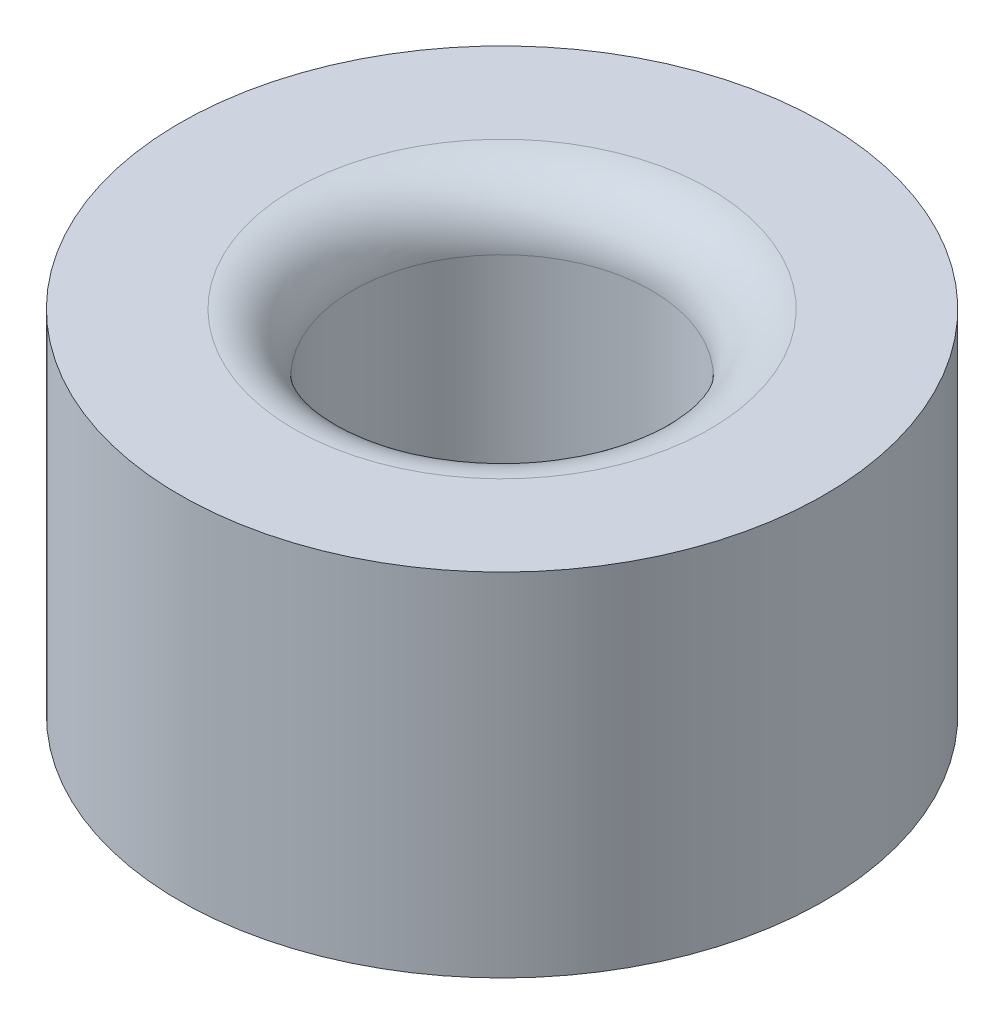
ISO-10303-21;
HEADER;
FILE_DESCRIPTION(('STEP AP214'),'2;1');
FILE_NAME('part.step','',(''),(''),'','','');
FILE_SCHEMA(('AUTOMOTIVE_DESIGN { 1 0 10303 214 1 1 1 1 }'));
ENDSEC;
DATA;
#1=APPLICATION_CONTEXT('core data for automotive mechanical design processes');
#2=APPLICATION_PROTOCOL_DEFINITION('international standard','automotive_design',2000,#1);
#3=PRODUCT_CONTEXT('',#1,'mechanical');
#4=PRODUCT('Part','Part','',(#3));
#5=PRODUCT_RELATED_PRODUCT_CATEGORY('part','',(#4));
#6=PRODUCT_DEFINITION_FORMATION('','',#4);
#7=PRODUCT_DEFINITION_CONTEXT('part definition',#1,'design');
#8=PRODUCT_DEFINITION('design','',#6,#7);
#9=PRODUCT_DEFINITION_SHAPE('','',#8);
#10=(LENGTH_UNIT() NAMED_UNIT(*) SI_UNIT(.MILLI.,.METRE.));
#11=(NAMED_UNIT(*) PLANE_ANGLE_UNIT() SI_UNIT($,.RADIAN.));
#12=(NAMED_UNIT(*) SI_UNIT($,.STERADIAN.) SOLID_ANGLE_UNIT());
#13=UNCERTAINTY_MEASURE_WITH_UNIT(LENGTH_MEASURE(1.E-05),#10,'distance_accuracy_value','');
#14=(GEOMETRIC_REPRESENTATION_CONTEXT(3) GLOBAL_UNCERTAINTY_ASSIGNED_CONTEXT((#13)) GLOBAL_UNIT_ASSIGNED_CONTEXT((#10,
#11,#12)) REPRESENTATION_CONTEXT('',''));
#15=CARTESIAN_POINT('',(0.,0.,0.));
#16=DIRECTION('',(0.,0.,1.));
#17=DIRECTION('',(1.,0.,0.));
#18=AXIS2_PLACEMENT_3D('',#15,#16,#17);
#19=CARTESIAN_POINT('',(0.,15.24,0.));
#20=DIRECTION('',(0.,1.,0.));
#21=DIRECTION('',(0.,0.,1.));
#22=AXIS2_PLACEMENT_3D('',#19,#20,#21);
#23=PLANE('',#22);
#24=CARTESIAN_POINT('',(0.,15.24,0.));
#25=DIRECTION('',(0.,1.,0.));
#26=DIRECTION('',(0.,0.,1.));
#27=AXIS2_PLACEMENT_3D('',#24,#25,#26);
#28=CIRCLE('',#27,9.017);
#29=CARTESIAN_POINT('',(0.,15.24,9.017));
#30=VERTEX_POINT('',#29);
#31=EDGE_CURVE('E10',#30,#30,#28,.F.);
#32=ORIENTED_EDGE('',*,*,#31,.T.);
#33=EDGE_LOOP('',(#32));
#34=FACE_BOUND('',#33,.T.);
#35=CARTESIAN_POINT('',(0.,15.24,0.));
#36=DIRECTION('',(0.,1.,0.));
#37=DIRECTION('',(0.,0.,1.));
#38=AXIS2_PLACEMENT_3D('',#35,#36,#37);
#39=CIRCLE('',#38,13.97);
#40=CARTESIAN_POINT('',(0.,15.24,-13.97));
#41=VERTEX_POINT('',#40);
#42=EDGE_CURVE('E61',#41,#41,#39,.T.);
#43=ORIENTED_EDGE('',*,*,#42,.T.);
#44=EDGE_LOOP('',(#43));
#45=FACE_BOUND('',#44,.T.);
#46=ADVANCED_FACE('F37',(#34,#45),#23,.T.);
#47=CARTESIAN_POINT('',(0.,0.,0.));
#48=DIRECTION('',(0.,1.,0.));
#49=DIRECTION('',(0.,0.,1.));
#50=AXIS2_PLACEMENT_3D('',#47,#48,#49);
#51=PLANE('',#50);
#52=CARTESIAN_POINT('',(0.,0.,0.));
#53=DIRECTION('',(0.,1.,0.));
#54=DIRECTION('',(0.,0.,1.));
#55=AXIS2_PLACEMENT_3D('',#52,#53,#54);
#56=CIRCLE('',#55,9.017);
#57=CARTESIAN_POINT('',(0.,0.,9.017));
#58=VERTEX_POINT('',#57);
#59=EDGE_CURVE('E55',#58,#58,#56,.T.);
#60=ORIENTED_EDGE('',*,*,#59,.T.);
#61=EDGE_LOOP('',(#60));
#62=FACE_BOUND('',#61,.T.);
#63=CARTESIAN_POINT('',(0.,0.,0.));
#64=DIRECTION('',(0.,1.,0.));
#65=DIRECTION('',(0.,0.,1.));
#66=AXIS2_PLACEMENT_3D('',#63,#64,#65);
#67=CIRCLE('',#66,13.97);
#68=CARTESIAN_POINT('',(0.,0.,-13.97));
#69=VERTEX_POINT('',#68);
#70=EDGE_CURVE('E62',#69,#69,#67,.T.);
#71=ORIENTED_EDGE('',*,*,#70,.F.);
#72=EDGE_LOOP('',(#71));
#73=FACE_BOUND('',#72,.T.);
#74=ADVANCED_FACE('F75',(#62,#73),#51,.F.);
#75=CARTESIAN_POINT('',(0.,15.24,0.));
#76=DIRECTION('',(0.,-1.,0.));
#77=DIRECTION('',(0.,0.,-1.));
#78=AXIS2_PLACEMENT_3D('',#75,#76,#77);
#79=CYLINDRICAL_SURFACE('',#78,13.97);
#80=CARTESIAN_POINT('',(0.,15.24,-13.97));
#81=CARTESIAN_POINT('',(0.,15.08125,-13.97));
#82=CARTESIAN_POINT('',(0.,14.9225,-13.97));
#83=CARTESIAN_POINT('',(0.,14.605,-13.97));
#84=CARTESIAN_POINT('',(0.,14.44625,-13.97));
#85=CARTESIAN_POINT('',(0.,14.12875,-13.97));
#86=CARTESIAN_POINT('',(0.,13.97,-13.97));
#87=CARTESIAN_POINT('',(0.,13.6525,-13.97));
#88=CARTESIAN_POINT('',(0.,13.49375,-13.97));
#89=CARTESIAN_POINT('',(0.,13.17625,-13.97));
#90=CARTESIAN_POINT('',(0.,13.0175,-13.97));
#91=CARTESIAN_POINT('',(0.,12.7,-13.97));
#92=CARTESIAN_POINT('',(0.,12.54125,-13.97));
#93=CARTESIAN_POINT('',(0.,12.22375,-13.97));
#94=CARTESIAN_POINT('',(0.,12.065,-13.97));
#95=CARTESIAN_POINT('',(0.,11.7475,-13.97));
#96=CARTESIAN_POINT('',(0.,11.58875,-13.97));
#97=CARTESIAN_POINT('',(0.,11.27125,-13.97));
#98=CARTESIAN_POINT('',(0.,11.1125,-13.97));
#99=CARTESIAN_POINT('',(0.,10.795,-13.97));
#100=CARTESIAN_POINT('',(0.,10.63625,-13.97));
#101=CARTESIAN_POINT('',(0.,10.31875,-13.97));
#102=CARTESIAN_POINT('',(0.,10.16,-13.97));
#103=CARTESIAN_POINT('',(0.,9.8425,-13.97));
#104=CARTESIAN_POINT('',(0.,9.68375,-13.97));
#105=CARTESIAN_POINT('',(0.,9.36625,-13.97));
#106=CARTESIAN_POINT('',(0.,9.2075,-13.97));
#107=CARTESIAN_POINT('',(0.,8.89,-13.97));
#108=CARTESIAN_POINT('',(0.,8.73125,-13.97));
#109=CARTESIAN_POINT('',(0.,8.41375,-13.97));
#110=CARTESIAN_POINT('',(0.,8.255,-13.97));
#111=CARTESIAN_POINT('',(0.,7.9375,-13.97));
#112=CARTESIAN_POINT('',(0.,7.77875,-13.97));
#113=CARTESIAN_POINT('',(0.,7.46125,-13.97));
#114=CARTESIAN_POINT('',(0.,7.3025,-13.97));
#115=CARTESIAN_POINT('',(0.,6.985,-13.97));
#116=CARTESIAN_POINT('',(0.,6.82625,-13.97));
#117=CARTESIAN_POINT('',(0.,6.50875,-13.97));
#118=CARTESIAN_POINT('',(0.,6.35,-13.97));
#119=CARTESIAN_POINT('',(0.,6.0325,-13.97));
#120=CARTESIAN_POINT('',(0.,5.87375,-13.97));
#121=CARTESIAN_POINT('',(0.,5.55625,-13.97));
#122=CARTESIAN_POINT('',(0.,5.3975,-13.97));
#123=CARTESIAN_POINT('',(0.,5.08,-13.97));
#124=CARTESIAN_POINT('',(0.,4.92125,-13.97));
#125=CARTESIAN_POINT('',(0.,4.60375,-13.97));
#126=CARTESIAN_POINT('',(0.,4.445,-13.97));
#127=CARTESIAN_POINT('',(0.,4.1275,-13.97));
#128=CARTESIAN_POINT('',(0.,3.96875,-13.97));
#129=CARTESIAN_POINT('',(0.,3.65125,-13.97));
#130=CARTESIAN_POINT('',(0.,3.4925,-13.97));
#131=CARTESIAN_POINT('',(0.,3.175,-13.97));
#132=CARTESIAN_POINT('',(0.,3.01625,-13.97));
#133=CARTESIAN_POINT('',(0.,2.69875,-13.97));
#134=CARTESIAN_POINT('',(0.,2.54,-13.97));
#135=CARTESIAN_POINT('',(0.,2.2225,-13.97));
#136=CARTESIAN_POINT('',(0.,2.06375,-13.97));
#137=CARTESIAN_POINT('',(0.,1.74625,-13.97));
#138=CARTESIAN_POINT('',(0.,1.5875,-13.97));
#139=CARTESIAN_POINT('',(0.,1.27,-13.97));
#140=CARTESIAN_POINT('',(0.,1.11125,-13.97));
#141=CARTESIAN_POINT('',(0.,0.79375,-13.97));
#142=CARTESIAN_POINT('',(0.,0.634999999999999,-13.97));
#143=CARTESIAN_POINT('',(0.,0.3175,-13.97));
#144=CARTESIAN_POINT('',(0.,0.15875,-13.97));
#145=CARTESIAN_POINT('',(0.,0.,-13.97));
#146=B_SPLINE_CURVE_WITH_KNOTS('',3,(#80,#81,#82,#83,#84,#85,#86,#87,#88,#89,#90,#91,#92,#93,
#94,#95,#96,#97,#98,#99,#100,#101,#102,#103,#104,#105,#106,#107,#108,#109,#110,#111,#112,#113,
#114,#115,#116,#117,#118,#119,#120,#121,#122,#123,#124,#125,#126,#127,#128,#129,#130,#131,#132,
#133,#134,#135,#136,#137,#138,#139,#140,#141,#142,#143,#144,#145),.UNSPECIFIED.,.F.,.F.,(4,2,2,
2,2,2,2,2,2,2,2,2,2,2,2,2,2,2,2,2,2,2,2,2,2,2,2,2,2,2,2,2,4),(0.,0.476249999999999,
0.952499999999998,1.42875,1.905,2.38125,2.8575,3.33375,3.81,4.28625,4.7625,5.23875,5.715,
6.19125,6.6675,7.14375,7.62,8.09625,8.5725,9.04875,9.525,10.00125,10.4775,10.95375,11.43,
11.90625,12.3825,12.85875,13.335,13.81125,14.2875,14.76375,15.24),.UNSPECIFIED.);
#147=EDGE_CURVE('BSEAM71',#41,#69,#146,.T.);
#148=ORIENTED_EDGE('',*,*,#42,.F.);
#149=ORIENTED_EDGE('',*,*,#70,.T.);
#150=ORIENTED_EDGE('',*,*,#147,.T.);
#151=ORIENTED_EDGE('',*,*,#147,.F.);
#152=EDGE_LOOP('',(#148,#150,#149,#151));
#153=FACE_BOUND('',#152,.T.);
#154=ADVANCED_FACE('F71',(#153),#79,.T.);
#155=CARTESIAN_POINT('',(0.,15.24,0.));
#156=DIRECTION('',(0.,-1.,0.));
#157=DIRECTION('',(0.,0.,-1.));
#158=AXIS2_PLACEMENT_3D('',#155,#156,#157);
#159=CYLINDRICAL_SURFACE('',#158,6.477);
#160=CARTESIAN_POINT('',(0.,2.54,0.));
#161=DIRECTION('',(0.,1.,0.));
#162=DIRECTION('',(0.,0.,1.));
#163=AXIS2_PLACEMENT_3D('',#160,#161,#162);
#164=CIRCLE('',#163,6.477);
#165=CARTESIAN_POINT('',(0.,2.54,-6.477));
#166=VERTEX_POINT('',#165);
#167=EDGE_CURVE('E45',#166,#166,#164,.F.);
#168=CARTESIAN_POINT('',(0.,12.7,0.));
#169=DIRECTION('',(0.,1.,0.));
#170=DIRECTION('',(0.,0.,1.));
#171=AXIS2_PLACEMENT_3D('',#168,#169,#170);
#172=CIRCLE('',#171,6.477);
#173=CARTESIAN_POINT('',(0.,12.7,-6.477));
#174=VERTEX_POINT('',#173);
#175=EDGE_CURVE('E50',#174,#174,#172,.T.);
#176=CARTESIAN_POINT('',(0.,2.54,-6.477));
#177=CARTESIAN_POINT('',(0.,2.64583333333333,-6.477));
#178=CARTESIAN_POINT('',(0.,2.75166666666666,-6.477));
#179=CARTESIAN_POINT('',(0.,2.96333333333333,-6.477));
#180=CARTESIAN_POINT('',(0.,3.06916666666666,-6.477));
#181=CARTESIAN_POINT('',(0.,3.28083333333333,-6.477));
#182=CARTESIAN_POINT('',(0.,3.38666666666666,-6.477));
#183=CARTESIAN_POINT('',(0.,3.59833333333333,-6.477));
#184=CARTESIAN_POINT('',(0.,3.70416666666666,-6.477));
#185=CARTESIAN_POINT('',(0.,3.91583333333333,-6.477));
#186=CARTESIAN_POINT('',(0.,4.02166666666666,-6.477));
#187=CARTESIAN_POINT('',(0.,4.23333333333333,-6.477));
#188=CARTESIAN_POINT('',(0.,4.33916666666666,-6.477));
#189=CARTESIAN_POINT('',(0.,4.55083333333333,-6.477));
#190=CARTESIAN_POINT('',(0.,4.65666666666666,-6.477));
#191=CARTESIAN_POINT('',(0.,4.86833333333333,-6.477));
#192=CARTESIAN_POINT('',(0.,4.97416666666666,-6.477));
#193=CARTESIAN_POINT('',(0.,5.18583333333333,-6.477));
#194=CARTESIAN_POINT('',(0.,5.29166666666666,-6.477));
#195=CARTESIAN_POINT('',(0.,5.50333333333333,-6.477));
#196=CARTESIAN_POINT('',(0.,5.60916666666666,-6.477));
#197=CARTESIAN_POINT('',(0.,5.82083333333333,-6.477));
#198=CARTESIAN_POINT('',(0.,5.92666666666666,-6.477));
#199=CARTESIAN_POINT('',(0.,6.13833333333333,-6.477));
#200=CARTESIAN_POINT('',(0.,6.24416666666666,-6.477));
#201=CARTESIAN_POINT('',(0.,6.45583333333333,-6.477));
#202=CARTESIAN_POINT('',(0.,6.56166666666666,-6.477));
#203=CARTESIAN_POINT('',(0.,6.77333333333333,-6.477));
#204=CARTESIAN_POINT('',(0.,6.87916666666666,-6.477));
#205=CARTESIAN_POINT('',(0.,7.09083333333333,-6.477));
#206=CARTESIAN_POINT('',(0.,7.19666666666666,-6.477));
#207=CARTESIAN_POINT('',(0.,7.40833333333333,-6.477));
#208=CARTESIAN_POINT('',(0.,7.51416666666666,-6.477));
#209=CARTESIAN_POINT('',(0.,7.72583333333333,-6.477));
#210=CARTESIAN_POINT('',(0.,7.83166666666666,-6.477));
#211=CARTESIAN_POINT('',(0.,8.04333333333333,-6.477));
#212=CARTESIAN_POINT('',(0.,8.14916666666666,-6.477));
#213=CARTESIAN_POINT('',(0.,8.36083333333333,-6.477));
#214=CARTESIAN_POINT('',(0.,8.46666666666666,-6.477));
#215=CARTESIAN_POINT('',(0.,8.67833333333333,-6.477));
#216=CARTESIAN_POINT('',(0.,8.78416666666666,-6.477));
#217=CARTESIAN_POINT('',(0.,8.99583333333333,-6.477));
#218=CARTESIAN_POINT('',(0.,9.10166666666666,-6.477));
#219=CARTESIAN_POINT('',(0.,9.31333333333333,-6.477));
#220=CARTESIAN_POINT('',(0.,9.41916666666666,-6.477));
#221=CARTESIAN_POINT('',(0.,9.63083333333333,-6.477));
#222=CARTESIAN_POINT('',(0.,9.73666666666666,-6.477));
#223=CARTESIAN_POINT('',(0.,9.94833333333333,-6.477));
#224=CARTESIAN_POINT('',(0.,10.0541666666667,-6.477));
#225=CARTESIAN_POINT('',(0.,10.2658333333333,-6.477));
#226=CARTESIAN_POINT('',(0.,10.3716666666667,-6.477));
#227=CARTESIAN_POINT('',(0.,10.5833333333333,-6.477));
#228=CARTESIAN_POINT('',(0.,10.6891666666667,-6.477));
#229=CARTESIAN_POINT('',(0.,10.9008333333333,-6.477));
#230=CARTESIAN_POINT('',(0.,11.0066666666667,-6.477));
#231=CARTESIAN_POINT('',(0.,11.2183333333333,-6.477));
#232=CARTESIAN_POINT('',(0.,11.3241666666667,-6.477));
#233=CARTESIAN_POINT('',(0.,11.5358333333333,-6.477));
#234=CARTESIAN_POINT('',(0.,11.6416666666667,-6.477));
#235=CARTESIAN_POINT('',(0.,11.8533333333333,-6.477));
#236=CARTESIAN_POINT('',(0.,11.9591666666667,-6.477));
#237=CARTESIAN_POINT('',(0.,12.1708333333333,-6.477));
#238=CARTESIAN_POINT('',(0.,12.2766666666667,-6.477));
#239=CARTESIAN_POINT('',(0.,12.4883333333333,-6.477));
#240=CARTESIAN_POINT('',(0.,12.5941666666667,-6.477));
#241=CARTESIAN_POINT('',(0.,12.7,-6.477));
#242=B_SPLINE_CURVE_WITH_KNOTS('',3,(#176,#177,#178,#179,#180,#181,#182,#183,#184,#185,#186,
#187,#188,#189,#190,#191,#192,#193,#194,#195,#196,#197,#198,#199,#200,#201,#202,#203,#204,#205,
#206,#207,#208,#209,#210,#211,#212,#213,#214,#215,#216,#217,#218,#219,#220,#221,#222,#223,#224,
#225,#226,#227,#228,#229,#230,#231,#232,#233,#234,#235,#236,#237,#238,#239,#240,#241),
.UNSPECIFIED.,.F.,.F.,(4,2,2,2,2,2,2,2,2,2,2,2,2,2,2,2,2,2,2,2,2,2,2,2,2,2,2,2,2,2,2,2,4),(0.,
0.3175,0.635,0.9525,1.27,1.5875,1.905,2.2225,2.54,2.8575,3.175,3.4925,3.81,4.1275,4.445,4.7625,
5.08,5.3975,5.715,6.0325,6.35,6.6675,6.985,7.3025,7.62,7.9375,8.255,8.5725,8.89,9.2075,9.525,
9.8425,10.16),.UNSPECIFIED.);
#243=EDGE_CURVE('BSEAM74',#166,#174,#242,.T.);
#244=ORIENTED_EDGE('',*,*,#167,.T.);
#245=ORIENTED_EDGE('',*,*,#175,.T.);
#246=ORIENTED_EDGE('',*,*,#243,.T.);
#247=ORIENTED_EDGE('',*,*,#243,.F.);
#248=EDGE_LOOP('',(#244,#246,#245,#247));
#249=FACE_BOUND('',#248,.T.);
#250=ADVANCED_FACE('F74',(#249),#159,.F.);
#251=CARTESIAN_POINT('',(0.,2.54,0.));
#252=DIRECTION('',(0.,1.,0.));
#253=DIRECTION('',(0.,0.,1.));
#254=AXIS2_PLACEMENT_3D('',#251,#252,#253);
#255=TOROIDAL_SURFACE('',#254,9.017,2.54);
#256=ORIENTED_EDGE('',*,*,#167,.F.);
#257=EDGE_LOOP('',(#256));
#258=FACE_BOUND('',#257,.T.);
#259=ORIENTED_EDGE('',*,*,#59,.F.);
#260=EDGE_LOOP('',(#259));
#261=FACE_BOUND('',#260,.T.);
#262=ADVANCED_FACE('F87',(#258,#261),#255,.T.);
#263=CARTESIAN_POINT('',(0.,12.7,0.));
#264=DIRECTION('',(0.,1.,0.));
#265=DIRECTION('',(0.,0.,1.));
#266=AXIS2_PLACEMENT_3D('',#263,#264,#265);
#267=TOROIDAL_SURFACE('',#266,9.017,2.54);
#268=ORIENTED_EDGE('',*,*,#31,.F.);
#269=EDGE_LOOP('',(#268));
#270=FACE_BOUND('',#269,.T.);
#271=ORIENTED_EDGE('',*,*,#175,.F.);
#272=EDGE_LOOP('',(#271));
#273=FACE_BOUND('',#272,.T.);
#274=ADVANCED_FACE('F39',(#270,#273),#267,.T.);
#275=CLOSED_SHELL('',(#46,#74,#154,#250,#262,#274));
#276=MANIFOLD_SOLID_BREP('B2',#275);
#277=ADVANCED_BREP_SHAPE_REPRESENTATION('',(#18,#276),#14);
#278=SHAPE_DEFINITION_REPRESENTATION(#9,#277);
ENDSEC;
END-ISO-10303-21;
